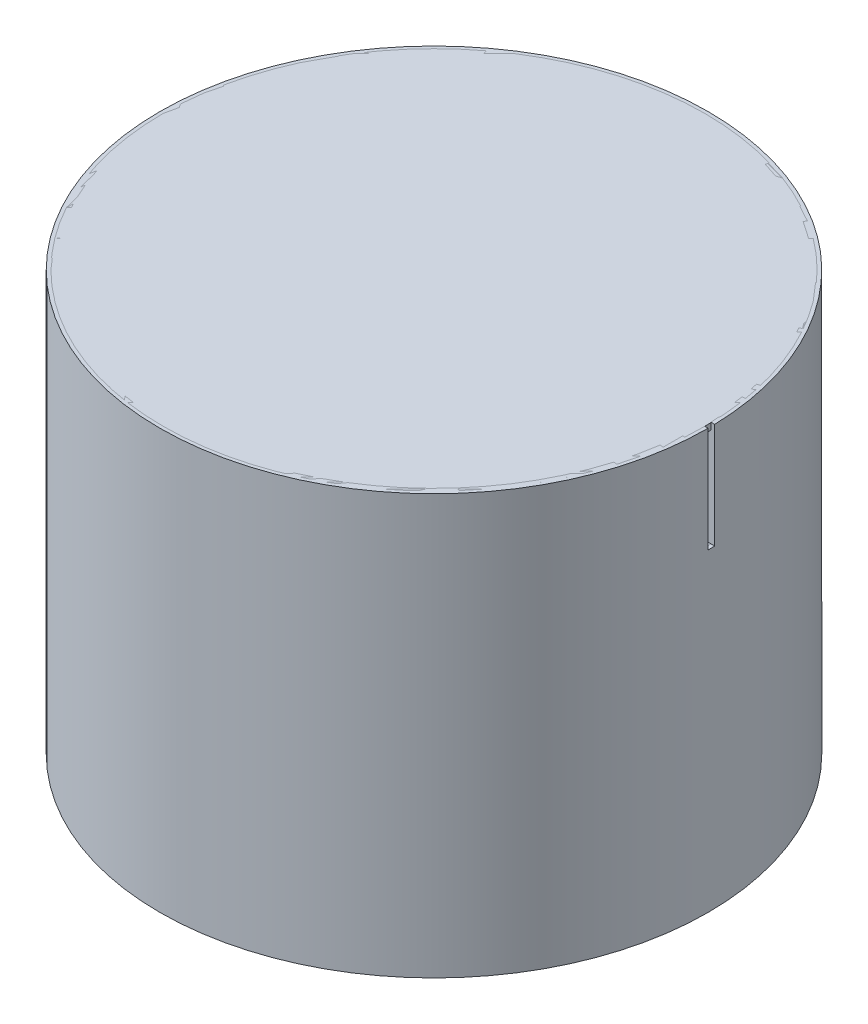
ISO-10303-21;
HEADER;
FILE_DESCRIPTION(('STEP AP214'),'2;1');
FILE_NAME('part.step','',(''),(''),'','','');
FILE_SCHEMA(('AUTOMOTIVE_DESIGN { 1 0 10303 214 1 1 1 1 }'));
ENDSEC;
DATA;
#1=APPLICATION_CONTEXT('core data for automotive mechanical design processes');
#2=APPLICATION_PROTOCOL_DEFINITION('international standard','automotive_design',2000,#1);
#3=PRODUCT_CONTEXT('',#1,'mechanical');
#4=PRODUCT('Part','Part','',(#3));
#5=PRODUCT_RELATED_PRODUCT_CATEGORY('part','',(#4));
#6=PRODUCT_DEFINITION_FORMATION('','',#4);
#7=PRODUCT_DEFINITION_CONTEXT('part definition',#1,'design');
#8=PRODUCT_DEFINITION('design','',#6,#7);
#9=PRODUCT_DEFINITION_SHAPE('','',#8);
#10=(LENGTH_UNIT() NAMED_UNIT(*) SI_UNIT(.MILLI.,.METRE.));
#11=(NAMED_UNIT(*) PLANE_ANGLE_UNIT() SI_UNIT($,.RADIAN.));
#12=(NAMED_UNIT(*) SI_UNIT($,.STERADIAN.) SOLID_ANGLE_UNIT());
#13=UNCERTAINTY_MEASURE_WITH_UNIT(LENGTH_MEASURE(1.E-05),#10,'distance_accuracy_value','');
#14=(GEOMETRIC_REPRESENTATION_CONTEXT(3) GLOBAL_UNCERTAINTY_ASSIGNED_CONTEXT((#13)) GLOBAL_UNIT_ASSIGNED_CONTEXT((#10,
#11,#12)) REPRESENTATION_CONTEXT('',''));
#15=CARTESIAN_POINT('',(0.,0.,0.));
#16=DIRECTION('',(0.,0.,1.));
#17=DIRECTION('',(1.,0.,0.));
#18=AXIS2_PLACEMENT_3D('',#15,#16,#17);
#19=CARTESIAN_POINT('',(0.,0.,0.));
#20=DIRECTION('',(0.,1.,0.));
#21=DIRECTION('',(-1.,0.,0.));
#22=AXIS2_PLACEMENT_3D('',#19,#20,#21);
#23=PLANE('',#22);
#24=CARTESIAN_POINT('',(0.,0.,0.));
#25=DIRECTION('',(0.,1.,0.));
#26=DIRECTION('',(-1.,0.,0.));
#27=AXIS2_PLACEMENT_3D('',#24,#25,#26);
#28=CIRCLE('',#27,98.7);
#29=CARTESIAN_POINT('',(-98.7,0.,0.));
#30=VERTEX_POINT('',#29);
#31=EDGE_CURVE('E11',#30,#30,#28,.T.);
#32=ORIENTED_EDGE('',*,*,#31,.F.);
#33=EDGE_LOOP('',(#32));
#34=FACE_BOUND('',#33,.T.);
#35=ADVANCED_FACE('F54',(#34),#23,.F.);
#36=CARTESIAN_POINT('',(0.,2.4,0.));
#37=DIRECTION('',(0.,1.,0.));
#38=DIRECTION('',(-1.,0.,0.));
#39=AXIS2_PLACEMENT_3D('',#36,#37,#38);
#40=CYLINDRICAL_SURFACE('',#39,98.7);
#41=ORIENTED_EDGE('',*,*,#31,.T.);
#42=EDGE_LOOP('',(#41));
#43=FACE_BOUND('',#42,.T.);
#44=CARTESIAN_POINT('',(0.,2.40000000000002,0.));
#45=DIRECTION('',(0.,1.,0.));
#46=DIRECTION('',(-1.,0.,0.));
#47=AXIS2_PLACEMENT_3D('',#44,#45,#46);
#48=CIRCLE('',#47,98.7);
#49=CARTESIAN_POINT('',(-98.7,2.40000000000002,0.));
#50=VERTEX_POINT('',#49);
#51=EDGE_CURVE('E60',#50,#50,#48,.T.);
#52=ORIENTED_EDGE('',*,*,#51,.F.);
#53=EDGE_LOOP('',(#52));
#54=FACE_BOUND('',#53,.T.);
#55=ADVANCED_FACE('F68',(#43,#54),#40,.T.);
#56=CARTESIAN_POINT('',(0.,2.40000000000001,0.));
#57=DIRECTION('',(0.,-1.,0.));
#58=DIRECTION('',(1.,0.,0.));
#59=AXIS2_PLACEMENT_3D('',#56,#57,#58);
#60=PLANE('',#59);
#61=ORIENTED_EDGE('',*,*,#51,.T.);
#62=EDGE_LOOP('',(#61));
#63=FACE_BOUND('',#62,.T.);
#64=ADVANCED_FACE('F66',(#63),#60,.F.);
#65=CLOSED_SHELL('',(#35,#55,#64));
#66=MANIFOLD_SOLID_BREP('B2',#65);
#67=CARTESIAN_POINT('',(0.,39.6,0.));
#68=DIRECTION('',(0.,-1.,0.));
#69=DIRECTION('',(0.,0.,-1.));
#70=AXIS2_PLACEMENT_3D('',#67,#68,#69);
#71=PLANE('',#70);
#72=CARTESIAN_POINT('',(0.,39.6,0.));
#73=DIRECTION('',(0.,-1.,0.));
#74=DIRECTION('',(0.,0.,-1.));
#75=AXIS2_PLACEMENT_3D('',#72,#73,#74);
#76=CIRCLE('',#75,32.);
#77=CARTESIAN_POINT('',(0.,39.6,-32.));
#78=VERTEX_POINT('',#77);
#79=EDGE_CURVE('E53',#78,#78,#76,.T.);
#80=ORIENTED_EDGE('',*,*,#79,.T.);
#81=EDGE_LOOP('',(#80));
#82=FACE_BOUND('',#81,.T.);
#83=ADVANCED_FACE('F106',(#82),#71,.T.);
#84=CARTESIAN_POINT('',(0.,18.4,0.));
#85=DIRECTION('',(0.,-1.,0.));
#86=DIRECTION('',(0.,0.,-1.));
#87=AXIS2_PLACEMENT_3D('',#84,#85,#86);
#88=CYLINDRICAL_SURFACE('',#87,32.);
#89=CARTESIAN_POINT('',(0.,38.4,0.));
#90=DIRECTION('',(0.,-1.,0.));
#91=DIRECTION('',(0.,0.,-1.));
#92=AXIS2_PLACEMENT_3D('',#89,#90,#91);
#93=CIRCLE('',#92,32.);
#94=CARTESIAN_POINT('',(0.,38.4,-32.));
#95=VERTEX_POINT('',#94);
#96=EDGE_CURVE('E112',#95,#95,#93,.T.);
#97=ORIENTED_EDGE('',*,*,#96,.T.);
#98=EDGE_LOOP('',(#97));
#99=FACE_BOUND('',#98,.T.);
#100=ORIENTED_EDGE('',*,*,#79,.F.);
#101=EDGE_LOOP('',(#100));
#102=FACE_BOUND('',#101,.T.);
#103=ADVANCED_FACE('F138',(#99,#102),#88,.F.);
#104=CARTESIAN_POINT('',(0.,38.4,0.));
#105=DIRECTION('',(0.,-1.,0.));
#106=DIRECTION('',(0.,0.,-1.));
#107=AXIS2_PLACEMENT_3D('',#104,#105,#106);
#108=PLANE('',#107);
#109=CARTESIAN_POINT('',(0.,38.4,0.));
#110=DIRECTION('',(0.,-1.,0.));
#111=DIRECTION('',(0.,0.,-1.));
#112=AXIS2_PLACEMENT_3D('',#109,#110,#111);
#113=CIRCLE('',#112,98.7);
#114=CARTESIAN_POINT('',(0.,38.4,-98.7));
#115=VERTEX_POINT('',#114);
#116=EDGE_CURVE('E116',#115,#115,#113,.T.);
#117=ORIENTED_EDGE('',*,*,#116,.T.);
#118=EDGE_LOOP('',(#117));
#119=FACE_BOUND('',#118,.T.);
#120=ORIENTED_EDGE('',*,*,#96,.F.);
#121=EDGE_LOOP('',(#120));
#122=FACE_BOUND('',#121,.T.);
#123=ADVANCED_FACE('F134',(#119,#122),#108,.T.);
#124=CARTESIAN_POINT('',(0.,18.4,0.));
#125=DIRECTION('',(0.,-1.,0.));
#126=DIRECTION('',(0.,0.,-1.));
#127=AXIS2_PLACEMENT_3D('',#124,#125,#126);
#128=CYLINDRICAL_SURFACE('',#127,98.7);
#129=ORIENTED_EDGE('',*,*,#116,.F.);
#130=EDGE_LOOP('',(#129));
#131=FACE_BOUND('',#130,.T.);
#132=CARTESIAN_POINT('',(0.,40.8,0.));
#133=DIRECTION('',(0.,-1.,0.));
#134=DIRECTION('',(0.,0.,-1.));
#135=AXIS2_PLACEMENT_3D('',#132,#133,#134);
#136=CIRCLE('',#135,98.7);
#137=CARTESIAN_POINT('',(0.,40.8,-98.7));
#138=VERTEX_POINT('',#137);
#139=EDGE_CURVE('E120',#138,#138,#136,.T.);
#140=ORIENTED_EDGE('',*,*,#139,.T.);
#141=EDGE_LOOP('',(#140));
#142=FACE_BOUND('',#141,.T.);
#143=ADVANCED_FACE('F126',(#131,#142),#128,.T.);
#144=CARTESIAN_POINT('',(0.,40.8,0.));
#145=DIRECTION('',(0.,1.,0.));
#146=DIRECTION('',(0.,0.,1.));
#147=AXIS2_PLACEMENT_3D('',#144,#145,#146);
#148=PLANE('',#147);
#149=ORIENTED_EDGE('',*,*,#139,.F.);
#150=EDGE_LOOP('',(#149));
#151=FACE_BOUND('',#150,.T.);
#152=ADVANCED_FACE('F128',(#151),#148,.T.);
#153=CLOSED_SHELL('',(#83,#103,#123,#143,#152));
#154=MANIFOLD_SOLID_BREP('B6_NOT_SHOWN',#153);
#155=CARTESIAN_POINT('',(0.,40.8,0.));
#156=DIRECTION('',(0.,1.,0.));
#157=DIRECTION('',(-1.,0.,0.));
#158=AXIS2_PLACEMENT_3D('',#155,#156,#157);
#159=CYLINDRICAL_SURFACE('',#158,32.);
#160=CARTESIAN_POINT('',(0.,38.4,0.));
#161=DIRECTION('',(0.,1.,0.));
#162=DIRECTION('',(-1.,0.,0.));
#163=AXIS2_PLACEMENT_3D('',#160,#161,#162);
#164=CIRCLE('',#163,32.);
#165=CARTESIAN_POINT('',(-32.,38.4,0.));
#166=VERTEX_POINT('',#165);
#167=EDGE_CURVE('E195',#166,#166,#164,.T.);
#168=ORIENTED_EDGE('',*,*,#167,.T.);
#169=EDGE_LOOP('',(#168));
#170=FACE_BOUND('',#169,.T.);
#171=CARTESIAN_POINT('',(0.,39.6,0.));
#172=DIRECTION('',(0.,1.,0.));
#173=DIRECTION('',(-1.,0.,0.));
#174=AXIS2_PLACEMENT_3D('',#171,#172,#173);
#175=CIRCLE('',#174,32.);
#176=CARTESIAN_POINT('',(-32.,39.6,0.));
#177=VERTEX_POINT('',#176);
#178=EDGE_CURVE('E105',#177,#177,#175,.T.);
#179=ORIENTED_EDGE('',*,*,#178,.F.);
#180=EDGE_LOOP('',(#179));
#181=FACE_BOUND('',#180,.T.);
#182=ADVANCED_FACE('F189',(#170,#181),#159,.T.);
#183=CARTESIAN_POINT('',(0.,39.6,0.));
#184=DIRECTION('',(0.,1.,0.));
#185=DIRECTION('',(-1.,0.,0.));
#186=AXIS2_PLACEMENT_3D('',#183,#184,#185);
#187=PLANE('',#186);
#188=ORIENTED_EDGE('',*,*,#178,.T.);
#189=EDGE_LOOP('',(#188));
#190=FACE_BOUND('',#189,.T.);
#191=ADVANCED_FACE('F205',(#190),#187,.T.);
#192=CARTESIAN_POINT('',(0.,38.4,0.));
#193=DIRECTION('',(0.,1.,0.));
#194=DIRECTION('',(-1.,0.,0.));
#195=AXIS2_PLACEMENT_3D('',#192,#193,#194);
#196=PLANE('',#195);
#197=ORIENTED_EDGE('',*,*,#167,.F.);
#198=EDGE_LOOP('',(#197));
#199=FACE_BOUND('',#198,.T.);
#200=ADVANCED_FACE('F203',(#199),#196,.F.);
#201=CLOSED_SHELL('',(#182,#191,#200));
#202=MANIFOLD_SOLID_BREP('B48_NOT_SHOWN',#201);
#203=CARTESIAN_POINT('',(0.,18.4,0.));
#204=DIRECTION('',(0.,-1.,0.));
#205=DIRECTION('',(0.,0.,-1.));
#206=AXIS2_PLACEMENT_3D('',#203,#204,#205);
#207=CYLINDRICAL_SURFACE('',#206,97.5);
#208=CARTESIAN_POINT('',(0.,-112.,0.));
#209=DIRECTION('',(0.,-1.,0.));
#210=DIRECTION('',(0.,0.,-1.));
#211=AXIS2_PLACEMENT_3D('',#208,#209,#210);
#212=CIRCLE('',#211,97.5);
#213=CARTESIAN_POINT('',(0.,-112.,-97.5));
#214=VERTEX_POINT('',#213);
#215=EDGE_CURVE('E187',#214,#214,#212,.T.);
#216=ORIENTED_EDGE('',*,*,#215,.T.);
#217=EDGE_LOOP('',(#216));
#218=FACE_BOUND('',#217,.T.);
#219=CARTESIAN_POINT('',(0.,2.40000000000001,0.));
#220=DIRECTION('',(0.,-1.,0.));
#221=DIRECTION('',(1.,0.,0.));
#222=AXIS2_PLACEMENT_3D('',#219,#220,#221);
#223=CIRCLE('',#222,97.5);
#224=CARTESIAN_POINT('',(97.5,2.4,0.));
#225=VERTEX_POINT('',#224);
#226=CARTESIAN_POINT('',(97.4704570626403,2.4,-2.4));
#227=VERTEX_POINT('',#226);
#228=EDGE_CURVE('E281',#225,#227,#223,.F.);
#229=ORIENTED_EDGE('',*,*,#228,.T.);
#230=DIRECTION('',(0.,1.,0.));
#231=VECTOR('',#230,1.);
#232=CARTESIAN_POINT('',(97.4704570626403,-1.01506645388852,-2.4));
#233=LINE('',#232,#231);
#234=CARTESIAN_POINT('',(97.4704570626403,40.8,-2.4));
#235=VERTEX_POINT('',#234);
#236=EDGE_CURVE('E273',#227,#235,#233,.T.);
#237=ORIENTED_EDGE('',*,*,#236,.T.);
#238=CARTESIAN_POINT('',(0.,40.8,0.));
#239=DIRECTION('',(0.,-1.,0.));
#240=DIRECTION('',(0.,0.,-1.));
#241=AXIS2_PLACEMENT_3D('',#238,#239,#240);
#242=CIRCLE('',#241,97.5);
#243=CARTESIAN_POINT('',(97.5,40.8,0.));
#244=VERTEX_POINT('',#243);
#245=EDGE_CURVE('E287',#244,#235,#242,.T.);
#246=ORIENTED_EDGE('',*,*,#245,.F.);
#247=DIRECTION('',(0.,1.,0.));
#248=VECTOR('',#247,1.);
#249=CARTESIAN_POINT('',(97.5,-1.01506645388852,0.));
#250=LINE('',#249,#248);
#251=EDGE_CURVE('E244',#225,#244,#250,.T.);
#252=ORIENTED_EDGE('',*,*,#251,.F.);
#253=EDGE_LOOP('',(#229,#237,#246,#252));
#254=FACE_BOUND('',#253,.T.);
#255=ADVANCED_FACE('F230',(#218,#254),#207,.F.);
#256=CARTESIAN_POINT('',(0.,18.4,0.));
#257=DIRECTION('',(0.,-1.,0.));
#258=DIRECTION('',(0.,0.,-1.));
#259=AXIS2_PLACEMENT_3D('',#256,#257,#258);
#260=CYLINDRICAL_SURFACE('',#259,99.9);
#261=CARTESIAN_POINT('',(0.,-112.,0.));
#262=DIRECTION('',(0.,-1.,0.));
#263=DIRECTION('',(0.,0.,-1.));
#264=AXIS2_PLACEMENT_3D('',#261,#262,#263);
#265=CIRCLE('',#264,99.9);
#266=CARTESIAN_POINT('',(0.,-112.,-99.9));
#267=VERTEX_POINT('',#266);
#268=EDGE_CURVE('E237',#267,#267,#265,.T.);
#269=ORIENTED_EDGE('',*,*,#268,.F.);
#270=EDGE_LOOP('',(#269));
#271=FACE_BOUND('',#270,.T.);
#272=CARTESIAN_POINT('',(0.,40.8,0.));
#273=DIRECTION('',(0.,-1.,0.));
#274=DIRECTION('',(0.,0.,-1.));
#275=AXIS2_PLACEMENT_3D('',#272,#273,#274);
#276=CIRCLE('',#275,99.9);
#277=CARTESIAN_POINT('',(99.9,40.8,0.));
#278=VERTEX_POINT('',#277);
#279=CARTESIAN_POINT('',(99.8711670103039,40.8,-2.4));
#280=VERTEX_POINT('',#279);
#281=EDGE_CURVE('E290',#278,#280,#276,.T.);
#282=ORIENTED_EDGE('',*,*,#281,.T.);
#283=DIRECTION('',(0.,1.,0.));
#284=VECTOR('',#283,1.);
#285=CARTESIAN_POINT('',(99.8711670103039,-1.01506645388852,-2.4));
#286=LINE('',#285,#284);
#287=CARTESIAN_POINT('',(99.8711670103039,2.4,-2.4));
#288=VERTEX_POINT('',#287);
#289=EDGE_CURVE('E276',#288,#280,#286,.T.);
#290=ORIENTED_EDGE('',*,*,#289,.F.);
#291=CARTESIAN_POINT('',(0.,2.40000000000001,0.));
#292=DIRECTION('',(0.,-1.,0.));
#293=DIRECTION('',(1.,0.,0.));
#294=AXIS2_PLACEMENT_3D('',#291,#292,#293);
#295=CIRCLE('',#294,99.9);
#296=CARTESIAN_POINT('',(99.9,2.4,0.));
#297=VERTEX_POINT('',#296);
#298=EDGE_CURVE('E308',#297,#288,#295,.F.);
#299=ORIENTED_EDGE('',*,*,#298,.F.);
#300=DIRECTION('',(0.,1.,0.));
#301=VECTOR('',#300,1.);
#302=CARTESIAN_POINT('',(99.9,-1.01506645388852,0.));
#303=LINE('',#302,#301);
#304=EDGE_CURVE('E291',#297,#278,#303,.T.);
#305=ORIENTED_EDGE('',*,*,#304,.T.);
#306=EDGE_LOOP('',(#282,#290,#299,#305));
#307=FACE_BOUND('',#306,.T.);
#308=ADVANCED_FACE('F303',(#271,#307),#260,.T.);
#309=CARTESIAN_POINT('',(0.,40.8,0.));
#310=DIRECTION('',(0.,1.,0.));
#311=DIRECTION('',(0.,0.,1.));
#312=AXIS2_PLACEMENT_3D('',#309,#310,#311);
#313=PLANE('',#312);
#314=ORIENTED_EDGE('',*,*,#245,.T.);
#315=DIRECTION('',(1.,0.,0.));
#316=VECTOR('',#315,1.);
#317=CARTESIAN_POINT('',(0.,40.8,-2.4));
#318=LINE('',#317,#316);
#319=EDGE_CURVE('E270',#235,#280,#318,.T.);
#320=ORIENTED_EDGE('',*,*,#319,.T.);
#321=ORIENTED_EDGE('',*,*,#281,.F.);
#322=DIRECTION('',(1.,0.,0.));
#323=VECTOR('',#322,1.);
#324=CARTESIAN_POINT('',(0.,40.8,0.));
#325=LINE('',#324,#323);
#326=EDGE_CURVE('E282',#244,#278,#325,.T.);
#327=ORIENTED_EDGE('',*,*,#326,.F.);
#328=EDGE_LOOP('',(#314,#320,#321,#327));
#329=FACE_BOUND('',#328,.T.);
#330=ADVANCED_FACE('F289',(#329),#313,.T.);
#331=CARTESIAN_POINT('',(-1.295260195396E-12,-112.,0.));
#332=DIRECTION('',(0.,-1.,0.));
#333=DIRECTION('',(0.,0.,-1.));
#334=AXIS2_PLACEMENT_3D('',#331,#332,#333);
#335=PLANE('',#334);
#336=ORIENTED_EDGE('',*,*,#268,.T.);
#337=EDGE_LOOP('',(#336));
#338=FACE_BOUND('',#337,.T.);
#339=ORIENTED_EDGE('',*,*,#215,.F.);
#340=EDGE_LOOP('',(#339));
#341=FACE_BOUND('',#340,.T.);
#342=ADVANCED_FACE('F300',(#338,#341),#335,.T.);
#343=CARTESIAN_POINT('',(0.,2.40000000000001,0.));
#344=DIRECTION('',(0.,-1.,0.));
#345=DIRECTION('',(1.,0.,0.));
#346=AXIS2_PLACEMENT_3D('',#343,#344,#345);
#347=PLANE('',#346);
#348=DIRECTION('',(1.,0.,0.));
#349=VECTOR('',#348,1.);
#350=CARTESIAN_POINT('',(0.,2.40000000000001,0.));
#351=LINE('',#350,#349);
#352=EDGE_CURVE('E251',#225,#297,#351,.T.);
#353=ORIENTED_EDGE('',*,*,#352,.T.);
#354=ORIENTED_EDGE('',*,*,#298,.T.);
#355=DIRECTION('',(1.,0.,0.));
#356=VECTOR('',#355,1.);
#357=CARTESIAN_POINT('',(0.,2.40000000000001,-2.4));
#358=LINE('',#357,#356);
#359=EDGE_CURVE('E313',#227,#288,#358,.T.);
#360=ORIENTED_EDGE('',*,*,#359,.F.);
#361=ORIENTED_EDGE('',*,*,#228,.F.);
#362=EDGE_LOOP('',(#353,#354,#360,#361));
#363=FACE_BOUND('',#362,.T.);
#364=ADVANCED_FACE('F317',(#363),#347,.F.);
#365=CARTESIAN_POINT('',(0.,-1.01506645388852,-2.4));
#366=DIRECTION('',(0.,0.,1.));
#367=DIRECTION('',(1.,0.,0.));
#368=AXIS2_PLACEMENT_3D('',#365,#366,#367);
#369=PLANE('',#368);
#370=ORIENTED_EDGE('',*,*,#359,.T.);
#371=ORIENTED_EDGE('',*,*,#289,.T.);
#372=ORIENTED_EDGE('',*,*,#319,.F.);
#373=ORIENTED_EDGE('',*,*,#236,.F.);
#374=EDGE_LOOP('',(#370,#371,#372,#373));
#375=FACE_BOUND('',#374,.T.);
#376=ADVANCED_FACE('F272',(#375),#369,.T.);
#377=CARTESIAN_POINT('',(0.,-1.01506645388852,0.));
#378=DIRECTION('',(0.,0.,1.));
#379=DIRECTION('',(1.,0.,0.));
#380=AXIS2_PLACEMENT_3D('',#377,#378,#379);
#381=PLANE('',#380);
#382=ORIENTED_EDGE('',*,*,#251,.T.);
#383=ORIENTED_EDGE('',*,*,#326,.T.);
#384=ORIENTED_EDGE('',*,*,#304,.F.);
#385=ORIENTED_EDGE('',*,*,#352,.F.);
#386=EDGE_LOOP('',(#382,#383,#384,#385));
#387=FACE_BOUND('',#386,.T.);
#388=ADVANCED_FACE('F309',(#387),#381,.F.);
#389=CLOSED_SHELL('',(#255,#308,#330,#342,#364,#376,#388));
#390=MANIFOLD_SOLID_BREP('B100_NOT_SHOWN',#389);
#391=ADVANCED_BREP_SHAPE_REPRESENTATION('',(#18,#66,#154,#202,#390),#14);
#392=SHAPE_DEFINITION_REPRESENTATION(#9,#391);
ENDSEC;
END-ISO-10303-21;
